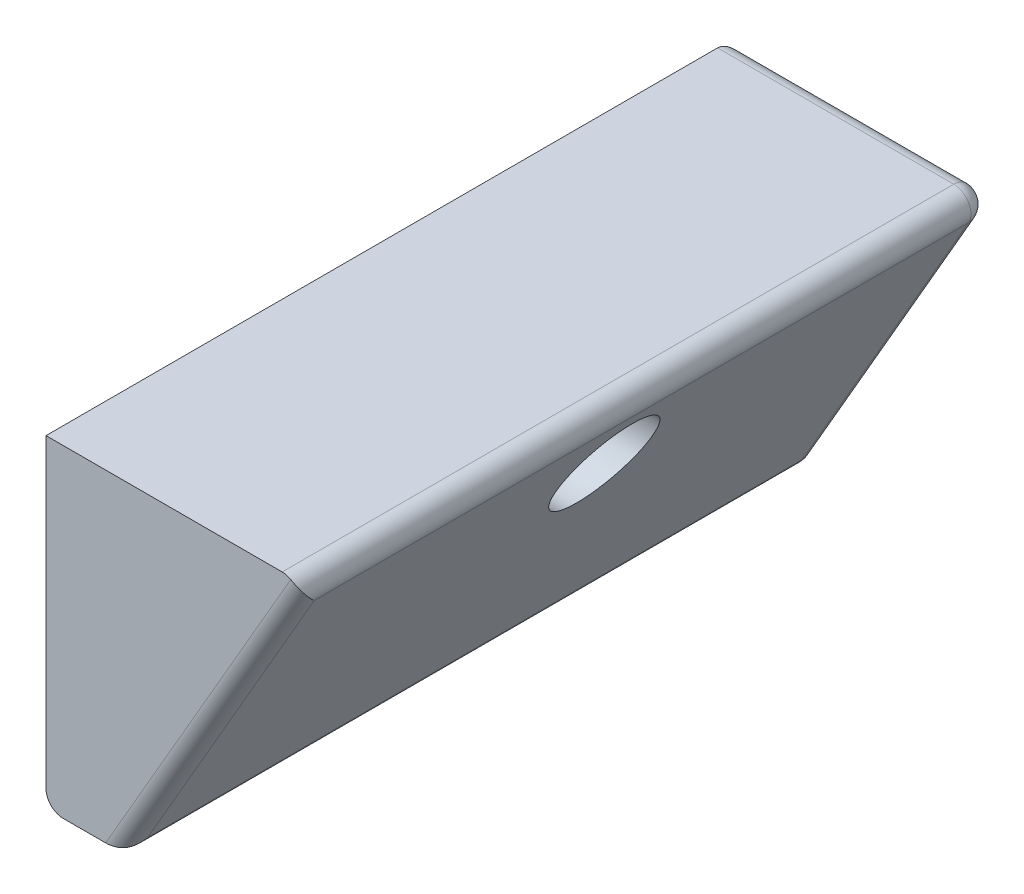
ISO-10303-21;
HEADER;
FILE_DESCRIPTION(('STEP AP214'),'2;1');
FILE_NAME('part.step','',(''),(''),'','','');
FILE_SCHEMA(('AUTOMOTIVE_DESIGN { 1 0 10303 214 1 1 1 1 }'));
ENDSEC;
DATA;
#1=APPLICATION_CONTEXT('core data for automotive mechanical design processes');
#2=APPLICATION_PROTOCOL_DEFINITION('international standard','automotive_design',2000,#1);
#3=PRODUCT_CONTEXT('',#1,'mechanical');
#4=PRODUCT('Part','Part','',(#3));
#5=PRODUCT_RELATED_PRODUCT_CATEGORY('part','',(#4));
#6=PRODUCT_DEFINITION_FORMATION('','',#4);
#7=PRODUCT_DEFINITION_CONTEXT('part definition',#1,'design');
#8=PRODUCT_DEFINITION('design','',#6,#7);
#9=PRODUCT_DEFINITION_SHAPE('','',#8);
#10=(LENGTH_UNIT() NAMED_UNIT(*) SI_UNIT(.MILLI.,.METRE.));
#11=(NAMED_UNIT(*) PLANE_ANGLE_UNIT() SI_UNIT($,.RADIAN.));
#12=(NAMED_UNIT(*) SI_UNIT($,.STERADIAN.) SOLID_ANGLE_UNIT());
#13=UNCERTAINTY_MEASURE_WITH_UNIT(LENGTH_MEASURE(1.E-05),#10,'distance_accuracy_value','');
#14=(GEOMETRIC_REPRESENTATION_CONTEXT(3) GLOBAL_UNCERTAINTY_ASSIGNED_CONTEXT((#13)) GLOBAL_UNIT_ASSIGNED_CONTEXT((#10,
#11,#12)) REPRESENTATION_CONTEXT('',''));
#15=CARTESIAN_POINT('',(0.,0.,0.));
#16=DIRECTION('',(0.,0.,1.));
#17=DIRECTION('',(1.,0.,0.));
#18=AXIS2_PLACEMENT_3D('',#15,#16,#17);
#19=CARTESIAN_POINT('',(56.,-264.339999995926,-0.0706342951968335));
#20=DIRECTION('',(-1.,0.,0.));
#21=DIRECTION('',(0.,0.,1.));
#22=AXIS2_PLACEMENT_3D('',#19,#20,#21);
#23=CYLINDRICAL_SURFACE('',#22,1.65000000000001);
#24=CARTESIAN_POINT('',(37.3350508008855,-264.339999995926,-0.0706342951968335));
#25=DIRECTION('',(1.,0.,0.));
#26=DIRECTION('',(0.,1.,0.));
#27=AXIS2_PLACEMENT_3D('',#24,#25,#26);
#28=CIRCLE('',#27,1.65000000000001);
#29=CARTESIAN_POINT('',(37.3350508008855,-262.689999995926,-0.0706342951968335));
#30=VERTEX_POINT('',#29);
#31=EDGE_CURVE('E122',#30,#30,#28,.F.);
#32=ORIENTED_EDGE('',*,*,#31,.T.);
#33=EDGE_LOOP('',(#32));
#34=FACE_BOUND('',#33,.T.);
#35=CARTESIAN_POINT('',(45.,-264.339999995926,-0.0706342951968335));
#36=DIRECTION('',(1.,0.,0.));
#37=DIRECTION('',(0.,0.,-1.));
#38=AXIS2_PLACEMENT_3D('',#35,#36,#37);
#39=CIRCLE('',#38,1.65000000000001);
#40=CARTESIAN_POINT('',(45.,-264.339999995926,-1.72063429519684));
#41=VERTEX_POINT('',#40);
#42=EDGE_CURVE('E142',#41,#41,#39,.T.);
#43=ORIENTED_EDGE('',*,*,#42,.T.);
#44=EDGE_LOOP('',(#43));
#45=FACE_BOUND('',#44,.T.);
#46=ADVANCED_FACE('F37',(#34,#45),#23,.F.);
#47=CARTESIAN_POINT('',(37.3350508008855,-259.227060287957,20.));
#48=DIRECTION('',(0.,-1.,0.));
#49=DIRECTION('',(0.,0.,-1.));
#50=AXIS2_PLACEMENT_3D('',#47,#48,#49);
#51=PLANE('',#50);
#52=DIRECTION('',(0.,0.,-1.));
#53=VECTOR('',#52,1.);
#54=CARTESIAN_POINT('',(51.0493819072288,-259.227060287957,20.));
#55=LINE('',#54,#53);
#56=CARTESIAN_POINT('',(51.0493819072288,-259.227060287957,20.));
#57=VERTEX_POINT('',#56);
#58=CARTESIAN_POINT('',(51.0493819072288,-259.227060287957,-19.));
#59=VERTEX_POINT('',#58);
#60=EDGE_CURVE('E62',#57,#59,#55,.T.);
#61=ORIENTED_EDGE('',*,*,#60,.T.);
#62=DIRECTION('',(-1.,0.,0.));
#63=VECTOR('',#62,1.);
#64=CARTESIAN_POINT('',(37.3350508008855,-259.227060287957,-19.));
#65=LINE('',#64,#63);
#66=CARTESIAN_POINT('',(37.3350508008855,-259.227060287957,-19.));
#67=VERTEX_POINT('',#66);
#68=EDGE_CURVE('E136',#59,#67,#65,.T.);
#69=ORIENTED_EDGE('',*,*,#68,.T.);
#70=DIRECTION('',(0.,0.,-1.));
#71=VECTOR('',#70,1.);
#72=CARTESIAN_POINT('',(37.3350508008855,-259.227060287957,20.));
#73=LINE('',#72,#71);
#74=CARTESIAN_POINT('',(37.3350508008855,-259.227060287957,20.));
#75=VERTEX_POINT('',#74);
#76=EDGE_CURVE('E128',#75,#67,#73,.T.);
#77=ORIENTED_EDGE('',*,*,#76,.F.);
#78=DIRECTION('',(-1.,0.,0.));
#79=VECTOR('',#78,1.);
#80=CARTESIAN_POINT('',(37.3350508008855,-259.227060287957,20.));
#81=LINE('',#80,#79);
#82=EDGE_CURVE('E115',#57,#75,#81,.T.);
#83=ORIENTED_EDGE('',*,*,#82,.F.);
#84=EDGE_LOOP('',(#61,#69,#77,#83));
#85=FACE_BOUND('',#84,.T.);
#86=ADVANCED_FACE('F134',(#85),#51,.F.);
#87=CARTESIAN_POINT('',(37.3350508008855,-277.980978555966,20.));
#88=DIRECTION('',(1.,0.,0.));
#89=DIRECTION('',(0.,1.,0.));
#90=AXIS2_PLACEMENT_3D('',#87,#88,#89);
#91=PLANE('',#90);
#92=ORIENTED_EDGE('',*,*,#31,.F.);
#93=EDGE_LOOP('',(#92));
#94=FACE_BOUND('',#93,.T.);
#95=ORIENTED_EDGE('',*,*,#76,.T.);
#96=DIRECTION('',(0.,-1.,0.));
#97=VECTOR('',#96,1.);
#98=CARTESIAN_POINT('',(37.3350508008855,-277.980978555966,-19.));
#99=LINE('',#98,#97);
#100=CARTESIAN_POINT('',(37.3350508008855,-276.980978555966,-19.));
#101=VERTEX_POINT('',#100);
#102=EDGE_CURVE('E138',#67,#101,#99,.T.);
#103=ORIENTED_EDGE('',*,*,#102,.T.);
#104=DIRECTION('',(0.,0.,-1.));
#105=VECTOR('',#104,1.);
#106=CARTESIAN_POINT('',(37.3350508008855,-276.980978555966,20.));
#107=LINE('',#106,#105);
#108=CARTESIAN_POINT('',(37.3350508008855,-276.980978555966,20.));
#109=VERTEX_POINT('',#108);
#110=EDGE_CURVE('E131',#101,#109,#107,.F.);
#111=ORIENTED_EDGE('',*,*,#110,.T.);
#112=DIRECTION('',(0.,-1.,0.));
#113=VECTOR('',#112,1.);
#114=CARTESIAN_POINT('',(37.3350508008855,-277.980978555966,20.));
#115=LINE('',#114,#113);
#116=EDGE_CURVE('E118',#75,#109,#115,.T.);
#117=ORIENTED_EDGE('',*,*,#116,.F.);
#118=EDGE_LOOP('',(#95,#103,#111,#117));
#119=FACE_BOUND('',#118,.T.);
#120=ADVANCED_FACE('F126',(#94,#119),#91,.F.);
#121=CARTESIAN_POINT('',(37.3350508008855,-277.980978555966,20.));
#122=DIRECTION('',(0.,1.,0.));
#123=DIRECTION('',(0.,0.,1.));
#124=AXIS2_PLACEMENT_3D('',#121,#122,#123);
#125=PLANE('',#124);
#126=DIRECTION('',(1.,0.,0.));
#127=VECTOR('',#126,1.);
#128=CARTESIAN_POINT('',(37.3350508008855,-277.980978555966,20.));
#129=LINE('',#128,#127);
#130=CARTESIAN_POINT('',(38.3350508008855,-277.980978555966,20.));
#131=VERTEX_POINT('',#130);
#132=CARTESIAN_POINT('',(40.7991524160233,-277.980978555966,20.));
#133=VERTEX_POINT('',#132);
#134=EDGE_CURVE('E132',#131,#133,#129,.T.);
#135=ORIENTED_EDGE('',*,*,#134,.F.);
#136=DIRECTION('',(0.,0.,-1.));
#137=VECTOR('',#136,1.);
#138=CARTESIAN_POINT('',(38.3350508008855,-277.980978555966,20.));
#139=LINE('',#138,#137);
#140=CARTESIAN_POINT('',(38.3350508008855,-277.980978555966,-19.));
#141=VERTEX_POINT('',#140);
#142=EDGE_CURVE('E165',#131,#141,#139,.T.);
#143=ORIENTED_EDGE('',*,*,#142,.T.);
#144=DIRECTION('',(1.,0.,0.));
#145=VECTOR('',#144,1.);
#146=CARTESIAN_POINT('',(37.3350508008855,-277.980978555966,-19.));
#147=LINE('',#146,#145);
#148=CARTESIAN_POINT('',(41.3765026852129,-277.980978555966,-19.));
#149=VERTEX_POINT('',#148);
#150=EDGE_CURVE('E163',#141,#149,#147,.T.);
#151=ORIENTED_EDGE('',*,*,#150,.T.);
#152=DIRECTION('',(0.,0.,-1.));
#153=VECTOR('',#152,1.);
#154=CARTESIAN_POINT('',(41.3765026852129,-277.980978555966,20.));
#155=LINE('',#154,#153);
#156=CARTESIAN_POINT('',(41.3765026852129,-277.980978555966,19.8660254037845));
#157=VERTEX_POINT('',#156);
#158=EDGE_CURVE('E161',#149,#157,#155,.F.);
#159=ORIENTED_EDGE('',*,*,#158,.T.);
#160=CARTESIAN_POINT('',(40.7991524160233,-277.980978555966,19.));
#161=DIRECTION('',(0.,1.,0.));
#162=DIRECTION('',(-1.,0.,0.));
#163=AXIS2_PLACEMENT_3D('',#160,#161,#162);
#164=ELLIPSE('',#163,1.15470053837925,1.);
#165=EDGE_CURVE('E159',#157,#133,#164,.F.);
#166=ORIENTED_EDGE('',*,*,#165,.T.);
#167=EDGE_LOOP('',(#135,#143,#151,#159,#166));
#168=FACE_BOUND('',#167,.T.);
#169=ADVANCED_FACE('F226',(#168),#125,.F.);
#170=CARTESIAN_POINT('',(52.7814327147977,-259.227060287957,20.));
#171=DIRECTION('',(-0.866025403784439,0.5,0.));
#172=DIRECTION('',(-0.5,-0.866025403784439,0.));
#173=AXIS2_PLACEMENT_3D('',#170,#171,#172);
#174=PLANE('',#173);
#175=DIRECTION('',(0.,0.,-1.));
#176=VECTOR('',#175,1.);
#177=CARTESIAN_POINT('',(42.2425280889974,-277.480978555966,20.));
#178=LINE('',#177,#176);
#179=CARTESIAN_POINT('',(42.2425280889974,-277.480978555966,19.));
#180=VERTEX_POINT('',#179);
#181=CARTESIAN_POINT('',(42.2425280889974,-277.480978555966,-19.));
#182=VERTEX_POINT('',#181);
#183=EDGE_CURVE('E171',#180,#182,#178,.T.);
#184=ORIENTED_EDGE('',*,*,#183,.T.);
#185=DIRECTION('',(0.5,0.866025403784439,0.));
#186=VECTOR('',#185,1.);
#187=CARTESIAN_POINT('',(52.7814327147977,-259.227060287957,-19.));
#188=LINE('',#187,#186);
#189=CARTESIAN_POINT('',(51.9154073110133,-260.727060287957,-19.));
#190=VERTEX_POINT('',#189);
#191=EDGE_CURVE('E173',#182,#190,#188,.T.);
#192=ORIENTED_EDGE('',*,*,#191,.T.);
#193=DIRECTION('',(0.,0.,-1.));
#194=VECTOR('',#193,1.);
#195=CARTESIAN_POINT('',(51.9154073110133,-260.727060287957,20.));
#196=LINE('',#195,#194);
#197=CARTESIAN_POINT('',(51.9154073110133,-260.727060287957,19.));
#198=VERTEX_POINT('',#197);
#199=EDGE_CURVE('E169',#190,#198,#196,.F.);
#200=ORIENTED_EDGE('',*,*,#199,.T.);
#201=DIRECTION('',(0.5,0.866025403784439,0.));
#202=VECTOR('',#201,1.);
#203=CARTESIAN_POINT('',(41.9538529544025,-277.980978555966,19.));
#204=LINE('',#203,#202);
#205=EDGE_CURVE('E167',#198,#180,#204,.F.);
#206=ORIENTED_EDGE('',*,*,#205,.T.);
#207=EDGE_LOOP('',(#184,#192,#200,#206));
#208=FACE_BOUND('',#207,.T.);
#209=CARTESIAN_POINT('',(49.829475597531,-264.339999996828,0.0706342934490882));
#210=DIRECTION('',(-0.866025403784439,0.5,0.));
#211=DIRECTION('',(-0.5,-0.866025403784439,0.));
#212=AXIS2_PLACEMENT_3D('',#209,#210,#211);
#213=ELLIPSE('',#212,3.23316150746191,2.80000000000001);
#214=CARTESIAN_POINT('',(48.2128948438,-267.139999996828,0.0706342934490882));
#215=VERTEX_POINT('',#214);
#216=EDGE_CURVE('E145',#215,#215,#213,.F.);
#217=ORIENTED_EDGE('',*,*,#216,.F.);
#218=EDGE_LOOP('',(#217));
#219=FACE_BOUND('',#218,.T.);
#220=ADVANCED_FACE('F232',(#208,#219),#174,.F.);
#221=CARTESIAN_POINT('',(0.,0.,20.));
#222=DIRECTION('',(0.,0.,1.));
#223=DIRECTION('',(1.,0.,0.));
#224=AXIS2_PLACEMENT_3D('',#221,#222,#223);
#225=PLANE('',#224);
#226=ORIENTED_EDGE('',*,*,#116,.T.);
#227=CARTESIAN_POINT('',(38.3350508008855,-276.980978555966,20.));
#228=DIRECTION('',(0.,0.,1.));
#229=DIRECTION('',(1.,0.,0.));
#230=AXIS2_PLACEMENT_3D('',#227,#228,#229);
#231=CIRCLE('',#230,1.);
#232=EDGE_CURVE('E11',#109,#131,#231,.T.);
#233=ORIENTED_EDGE('',*,*,#232,.T.);
#234=ORIENTED_EDGE('',*,*,#134,.T.);
#235=DIRECTION('',(0.5,0.866025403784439,0.));
#236=VECTOR('',#235,1.);
#237=CARTESIAN_POINT('',(51.9154073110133,-258.727060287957,20.));
#238=LINE('',#237,#236);
#239=CARTESIAN_POINT('',(51.5493819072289,-259.361034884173,20.));
#240=VERTEX_POINT('',#239);
#241=EDGE_CURVE('E54',#133,#240,#238,.T.);
#242=ORIENTED_EDGE('',*,*,#241,.T.);
#243=CARTESIAN_POINT('',(51.0493819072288,-260.227060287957,20.));
#244=DIRECTION('',(0.,0.,1.));
#245=DIRECTION('',(1.,0.,0.));
#246=AXIS2_PLACEMENT_3D('',#243,#244,#245);
#247=CIRCLE('',#246,1.);
#248=EDGE_CURVE('E46',#240,#57,#247,.T.);
#249=ORIENTED_EDGE('',*,*,#248,.T.);
#250=ORIENTED_EDGE('',*,*,#82,.T.);
#251=EDGE_LOOP('',(#226,#233,#234,#242,#249,#250));
#252=FACE_BOUND('',#251,.T.);
#253=ADVANCED_FACE('F117',(#252),#225,.T.);
#254=CARTESIAN_POINT('',(0.,0.,-20.));
#255=DIRECTION('',(0.,0.,1.));
#256=DIRECTION('',(1.,0.,0.));
#257=AXIS2_PLACEMENT_3D('',#254,#255,#256);
#258=PLANE('',#257);
#259=DIRECTION('',(1.,0.,0.));
#260=VECTOR('',#259,1.);
#261=CARTESIAN_POINT('',(0.,-276.980978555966,-20.));
#262=LINE('',#261,#260);
#263=CARTESIAN_POINT('',(41.3765026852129,-276.980978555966,-20.));
#264=VERTEX_POINT('',#263);
#265=CARTESIAN_POINT('',(38.3350508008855,-276.980978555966,-20.));
#266=VERTEX_POINT('',#265);
#267=EDGE_CURVE('E154',#264,#266,#262,.F.);
#268=ORIENTED_EDGE('',*,*,#267,.T.);
#269=DIRECTION('',(0.,-1.,0.));
#270=VECTOR('',#269,1.);
#271=CARTESIAN_POINT('',(38.3350508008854,0.,-20.));
#272=LINE('',#271,#270);
#273=CARTESIAN_POINT('',(38.3350508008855,-260.227060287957,-20.));
#274=VERTEX_POINT('',#273);
#275=EDGE_CURVE('E156',#266,#274,#272,.F.);
#276=ORIENTED_EDGE('',*,*,#275,.T.);
#277=DIRECTION('',(-1.,0.,0.));
#278=VECTOR('',#277,1.);
#279=CARTESIAN_POINT('',(0.,-260.227060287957,-20.));
#280=LINE('',#279,#278);
#281=CARTESIAN_POINT('',(51.0493819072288,-260.227060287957,-20.));
#282=VERTEX_POINT('',#281);
#283=EDGE_CURVE('E150',#274,#282,#280,.F.);
#284=ORIENTED_EDGE('',*,*,#283,.T.);
#285=DIRECTION('',(0.5,0.866025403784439,0.));
#286=VECTOR('',#285,1.);
#287=CARTESIAN_POINT('',(150.968658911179,-87.1617958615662,-20.));
#288=LINE('',#287,#286);
#289=EDGE_CURVE('E152',#282,#264,#288,.F.);
#290=ORIENTED_EDGE('',*,*,#289,.T.);
#291=EDGE_LOOP('',(#268,#276,#284,#290));
#292=FACE_BOUND('',#291,.T.);
#293=ADVANCED_FACE('F246',(#292),#258,.F.);
#294=CARTESIAN_POINT('',(101.,-264.339999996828,0.0706342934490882));
#295=DIRECTION('',(-1.,0.,0.));
#296=DIRECTION('',(0.,0.,1.));
#297=AXIS2_PLACEMENT_3D('',#294,#295,#296);
#298=CYLINDRICAL_SURFACE('',#297,2.80000000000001);
#299=CARTESIAN_POINT('',(45.,-264.339999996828,0.0706342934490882));
#300=DIRECTION('',(1.,0.,0.));
#301=DIRECTION('',(0.,0.,-1.));
#302=AXIS2_PLACEMENT_3D('',#299,#300,#301);
#303=CIRCLE('',#302,2.80000000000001);
#304=CARTESIAN_POINT('',(45.,-264.339999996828,-2.72936570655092));
#305=VERTEX_POINT('',#304);
#306=EDGE_CURVE('E146',#305,#305,#303,.T.);
#307=ORIENTED_EDGE('',*,*,#306,.F.);
#308=EDGE_LOOP('',(#307));
#309=FACE_BOUND('',#308,.T.);
#310=ORIENTED_EDGE('',*,*,#216,.T.);
#311=EDGE_LOOP('',(#310));
#312=FACE_BOUND('',#311,.T.);
#313=ADVANCED_FACE('F242',(#309,#312),#298,.F.);
#314=CARTESIAN_POINT('',(45.,-264.339999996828,0.0706342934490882));
#315=DIRECTION('',(1.,0.,0.));
#316=DIRECTION('',(0.,0.,-1.));
#317=AXIS2_PLACEMENT_3D('',#314,#315,#316);
#318=PLANE('',#317);
#319=ORIENTED_EDGE('',*,*,#42,.F.);
#320=EDGE_LOOP('',(#319));
#321=FACE_BOUND('',#320,.T.);
#322=ORIENTED_EDGE('',*,*,#306,.T.);
#323=EDGE_LOOP('',(#322));
#324=FACE_BOUND('',#323,.T.);
#325=ADVANCED_FACE('F259',(#321,#324),#318,.T.);
#326=CARTESIAN_POINT('',(150.968658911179,-87.1617958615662,19.));
#327=DIRECTION('',(-0.5,-0.866025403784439,0.));
#328=DIRECTION('',(0.866025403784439,-0.5,0.));
#329=AXIS2_PLACEMENT_3D('',#326,#327,#328);
#330=CYLINDRICAL_SURFACE('',#329,1.);
#331=ORIENTED_EDGE('',*,*,#241,.F.);
#332=ORIENTED_EDGE('',*,*,#165,.F.);
#333=CARTESIAN_POINT('',(41.3765026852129,-276.980978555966,19.));
#334=DIRECTION('',(-0.353553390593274,-0.612372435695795,-0.707106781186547));
#335=DIRECTION('',(-0.353553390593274,-0.612372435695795,0.707106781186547));
#336=AXIS2_PLACEMENT_3D('',#333,#334,#335);
#337=ELLIPSE('',#336,1.41421356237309,1.);
#338=EDGE_CURVE('E41',#180,#157,#337,.T.);
#339=ORIENTED_EDGE('',*,*,#338,.F.);
#340=ORIENTED_EDGE('',*,*,#205,.F.);
#341=CARTESIAN_POINT('',(51.0493819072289,-260.227060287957,19.));
#342=DIRECTION('',(-0.353553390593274,-0.612372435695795,0.707106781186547));
#343=DIRECTION('',(-0.353553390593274,-0.612372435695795,-0.707106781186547));
#344=AXIS2_PLACEMENT_3D('',#341,#342,#343);
#345=ELLIPSE('',#344,1.41421356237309,1.);
#346=EDGE_CURVE('E206',#240,#198,#345,.F.);
#347=ORIENTED_EDGE('',*,*,#346,.F.);
#348=EDGE_LOOP('',(#331,#332,#339,#340,#347));
#349=FACE_BOUND('',#348,.T.);
#350=ADVANCED_FACE('F39',(#349),#330,.T.);
#351=CARTESIAN_POINT('',(41.3765026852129,-276.980978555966,20.));
#352=DIRECTION('',(0.,0.,-1.));
#353=DIRECTION('',(-1.,0.,0.));
#354=AXIS2_PLACEMENT_3D('',#351,#352,#353);
#355=CYLINDRICAL_SURFACE('',#354,1.);
#356=ORIENTED_EDGE('',*,*,#338,.T.);
#357=ORIENTED_EDGE('',*,*,#158,.F.);
#358=CARTESIAN_POINT('',(41.3765026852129,-276.980978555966,-19.));
#359=DIRECTION('',(0.,0.,-1.));
#360=DIRECTION('',(-1.,0.,0.));
#361=AXIS2_PLACEMENT_3D('',#358,#359,#360);
#362=CIRCLE('',#361,1.);
#363=EDGE_CURVE('E204',#182,#149,#362,.T.);
#364=ORIENTED_EDGE('',*,*,#363,.F.);
#365=ORIENTED_EDGE('',*,*,#183,.F.);
#366=EDGE_LOOP('',(#356,#357,#364,#365));
#367=FACE_BOUND('',#366,.T.);
#368=ADVANCED_FACE('F268',(#367),#355,.T.);
#369=CARTESIAN_POINT('',(51.9154073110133,-258.727060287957,-19.));
#370=DIRECTION('',(0.5,0.866025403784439,0.));
#371=DIRECTION('',(-0.866025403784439,0.5,0.));
#372=AXIS2_PLACEMENT_3D('',#369,#370,#371);
#373=CYLINDRICAL_SURFACE('',#372,1.);
#374=CARTESIAN_POINT('',(51.0493819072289,-260.227060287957,-19.));
#375=DIRECTION('',(0.500000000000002,0.866025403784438,0.));
#376=DIRECTION('',(-0.866025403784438,0.500000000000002,0.));
#377=AXIS2_PLACEMENT_3D('',#374,#375,#376);
#378=CIRCLE('',#377,1.);
#379=EDGE_CURVE('E198',#190,#282,#378,.T.);
#380=ORIENTED_EDGE('',*,*,#379,.F.);
#381=ORIENTED_EDGE('',*,*,#191,.F.);
#382=CARTESIAN_POINT('',(41.3765026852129,-276.980978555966,-19.));
#383=DIRECTION('',(-0.499999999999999,-0.866025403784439,0.));
#384=DIRECTION('',(0.86602540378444,-0.499999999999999,0.));
#385=AXIS2_PLACEMENT_3D('',#382,#383,#384);
#386=CIRCLE('',#385,1.);
#387=EDGE_CURVE('E201',#264,#182,#386,.T.);
#388=ORIENTED_EDGE('',*,*,#387,.F.);
#389=ORIENTED_EDGE('',*,*,#289,.F.);
#390=EDGE_LOOP('',(#380,#381,#388,#389));
#391=FACE_BOUND('',#390,.T.);
#392=ADVANCED_FACE('F274',(#391),#373,.T.);
#393=CARTESIAN_POINT('',(51.0493819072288,-260.227060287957,20.));
#394=DIRECTION('',(0.,0.,-1.));
#395=DIRECTION('',(-1.,0.,0.));
#396=AXIS2_PLACEMENT_3D('',#393,#394,#395);
#397=CYLINDRICAL_SURFACE('',#396,1.);
#398=ORIENTED_EDGE('',*,*,#346,.T.);
#399=ORIENTED_EDGE('',*,*,#199,.F.);
#400=CARTESIAN_POINT('',(51.0493819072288,-260.227060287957,-19.));
#401=DIRECTION('',(0.,0.,-1.));
#402=DIRECTION('',(-1.,0.,0.));
#403=AXIS2_PLACEMENT_3D('',#400,#401,#402);
#404=CIRCLE('',#403,1.);
#405=EDGE_CURVE('E196',#59,#190,#404,.T.);
#406=ORIENTED_EDGE('',*,*,#405,.F.);
#407=ORIENTED_EDGE('',*,*,#60,.F.);
#408=ORIENTED_EDGE('',*,*,#248,.F.);
#409=EDGE_LOOP('',(#398,#399,#406,#407,#408));
#410=FACE_BOUND('',#409,.T.);
#411=ADVANCED_FACE('F277',(#410),#397,.T.);
#412=CARTESIAN_POINT('',(41.3765026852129,-276.980978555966,-19.));
#413=DIRECTION('',(0.,0.,-1.));
#414=DIRECTION('',(-1.,0.,0.));
#415=AXIS2_PLACEMENT_3D('',#412,#413,#414);
#416=SPHERICAL_SURFACE('',#415,1.);
#417=ORIENTED_EDGE('',*,*,#387,.T.);
#418=ORIENTED_EDGE('',*,*,#363,.T.);
#419=CARTESIAN_POINT('',(41.3765026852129,-276.980978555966,-19.));
#420=DIRECTION('',(1.,0.,0.));
#421=DIRECTION('',(0.,0.,-1.));
#422=AXIS2_PLACEMENT_3D('',#419,#420,#421);
#423=CIRCLE('',#422,1.);
#424=EDGE_CURVE('E193',#264,#149,#423,.F.);
#425=ORIENTED_EDGE('',*,*,#424,.F.);
#426=EDGE_LOOP('',(#417,#418,#425));
#427=FACE_BOUND('',#426,.T.);
#428=ADVANCED_FACE('F302',(#427),#416,.T.);
#429=CARTESIAN_POINT('',(51.0493819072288,-260.227060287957,-19.));
#430=DIRECTION('',(0.,0.,-1.));
#431=DIRECTION('',(-1.,0.,0.));
#432=AXIS2_PLACEMENT_3D('',#429,#430,#431);
#433=SPHERICAL_SURFACE('',#432,1.);
#434=ORIENTED_EDGE('',*,*,#405,.T.);
#435=ORIENTED_EDGE('',*,*,#379,.T.);
#436=CARTESIAN_POINT('',(51.0493819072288,-260.227060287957,-19.));
#437=DIRECTION('',(1.,0.,0.));
#438=DIRECTION('',(0.,0.,-1.));
#439=AXIS2_PLACEMENT_3D('',#436,#437,#438);
#440=CIRCLE('',#439,1.);
#441=EDGE_CURVE('E190',#59,#282,#440,.F.);
#442=ORIENTED_EDGE('',*,*,#441,.F.);
#443=EDGE_LOOP('',(#434,#435,#442));
#444=FACE_BOUND('',#443,.T.);
#445=ADVANCED_FACE('F281',(#444),#433,.T.);
#446=CARTESIAN_POINT('',(38.3350508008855,-276.980978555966,20.));
#447=DIRECTION('',(0.,0.,-1.));
#448=DIRECTION('',(-1.,0.,0.));
#449=AXIS2_PLACEMENT_3D('',#446,#447,#448);
#450=CYLINDRICAL_SURFACE('',#449,1.);
#451=ORIENTED_EDGE('',*,*,#232,.F.);
#452=ORIENTED_EDGE('',*,*,#110,.F.);
#453=CARTESIAN_POINT('',(38.3350508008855,-276.980978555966,-19.));
#454=DIRECTION('',(0.,0.,-1.));
#455=DIRECTION('',(-1.,0.,0.));
#456=AXIS2_PLACEMENT_3D('',#453,#454,#455);
#457=CIRCLE('',#456,1.);
#458=EDGE_CURVE('E187',#141,#101,#457,.T.);
#459=ORIENTED_EDGE('',*,*,#458,.F.);
#460=ORIENTED_EDGE('',*,*,#142,.F.);
#461=EDGE_LOOP('',(#451,#452,#459,#460));
#462=FACE_BOUND('',#461,.T.);
#463=ADVANCED_FACE('F296',(#462),#450,.T.);
#464=CARTESIAN_POINT('',(37.3350508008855,-276.980978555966,-19.));
#465=DIRECTION('',(1.,0.,0.));
#466=DIRECTION('',(0.,0.,-1.));
#467=AXIS2_PLACEMENT_3D('',#464,#465,#466);
#468=CYLINDRICAL_SURFACE('',#467,1.);
#469=ORIENTED_EDGE('',*,*,#424,.T.);
#470=ORIENTED_EDGE('',*,*,#150,.F.);
#471=CARTESIAN_POINT('',(38.3350508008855,-276.980978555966,-19.));
#472=DIRECTION('',(-1.,0.,0.));
#473=DIRECTION('',(0.,0.,1.));
#474=AXIS2_PLACEMENT_3D('',#471,#472,#473);
#475=CIRCLE('',#474,1.);
#476=EDGE_CURVE('E184',#266,#141,#475,.T.);
#477=ORIENTED_EDGE('',*,*,#476,.F.);
#478=ORIENTED_EDGE('',*,*,#267,.F.);
#479=EDGE_LOOP('',(#469,#470,#477,#478));
#480=FACE_BOUND('',#479,.T.);
#481=ADVANCED_FACE('F306',(#480),#468,.T.);
#482=CARTESIAN_POINT('',(37.3350508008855,-260.227060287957,-19.));
#483=DIRECTION('',(-1.,0.,0.));
#484=DIRECTION('',(0.,0.,1.));
#485=AXIS2_PLACEMENT_3D('',#482,#483,#484);
#486=CYLINDRICAL_SURFACE('',#485,1.);
#487=ORIENTED_EDGE('',*,*,#441,.T.);
#488=ORIENTED_EDGE('',*,*,#283,.F.);
#489=CARTESIAN_POINT('',(38.3350508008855,-260.227060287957,-19.));
#490=DIRECTION('',(-0.707106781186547,-0.707106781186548,0.));
#491=DIRECTION('',(-0.707106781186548,0.707106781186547,0.));
#492=AXIS2_PLACEMENT_3D('',#489,#490,#491);
#493=ELLIPSE('',#492,1.4142135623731,1.);
#494=EDGE_CURVE('E182',#67,#274,#493,.T.);
#495=ORIENTED_EDGE('',*,*,#494,.F.);
#496=ORIENTED_EDGE('',*,*,#68,.F.);
#497=EDGE_LOOP('',(#487,#488,#495,#496));
#498=FACE_BOUND('',#497,.T.);
#499=ADVANCED_FACE('F284',(#498),#486,.T.);
#500=CARTESIAN_POINT('',(38.3350508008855,-276.980978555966,-19.));
#501=DIRECTION('',(0.,-1.,0.));
#502=DIRECTION('',(0.,0.,-1.));
#503=AXIS2_PLACEMENT_3D('',#500,#501,#502);
#504=SPHERICAL_SURFACE('',#503,1.);
#505=ORIENTED_EDGE('',*,*,#476,.T.);
#506=ORIENTED_EDGE('',*,*,#458,.T.);
#507=CARTESIAN_POINT('',(38.3350508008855,-276.980978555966,-19.));
#508=DIRECTION('',(0.,-1.,0.));
#509=DIRECTION('',(0.,0.,-1.));
#510=AXIS2_PLACEMENT_3D('',#507,#508,#509);
#511=CIRCLE('',#510,1.);
#512=EDGE_CURVE('E180',#266,#101,#511,.F.);
#513=ORIENTED_EDGE('',*,*,#512,.F.);
#514=EDGE_LOOP('',(#505,#506,#513));
#515=FACE_BOUND('',#514,.T.);
#516=ADVANCED_FACE('F292',(#515),#504,.T.);
#517=CARTESIAN_POINT('',(38.3350508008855,-277.980978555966,-19.));
#518=DIRECTION('',(0.,-1.,0.));
#519=DIRECTION('',(1.,0.,0.));
#520=AXIS2_PLACEMENT_3D('',#517,#518,#519);
#521=CYLINDRICAL_SURFACE('',#520,1.);
#522=ORIENTED_EDGE('',*,*,#494,.T.);
#523=ORIENTED_EDGE('',*,*,#275,.F.);
#524=ORIENTED_EDGE('',*,*,#512,.T.);
#525=ORIENTED_EDGE('',*,*,#102,.F.);
#526=EDGE_LOOP('',(#522,#523,#524,#525));
#527=FACE_BOUND('',#526,.T.);
#528=ADVANCED_FACE('F288',(#527),#521,.T.);
#529=CLOSED_SHELL('',(#46,#86,#120,#169,#220,#253,#293,#313,#325,#350,#368,#392,#411,#428,#445,
#463,#481,#499,#516,#528));
#530=MANIFOLD_SOLID_BREP('B2',#529);
#531=ADVANCED_BREP_SHAPE_REPRESENTATION('',(#18,#530),#14);
#532=SHAPE_DEFINITION_REPRESENTATION(#9,#531);
ENDSEC;
END-ISO-10303-21;
